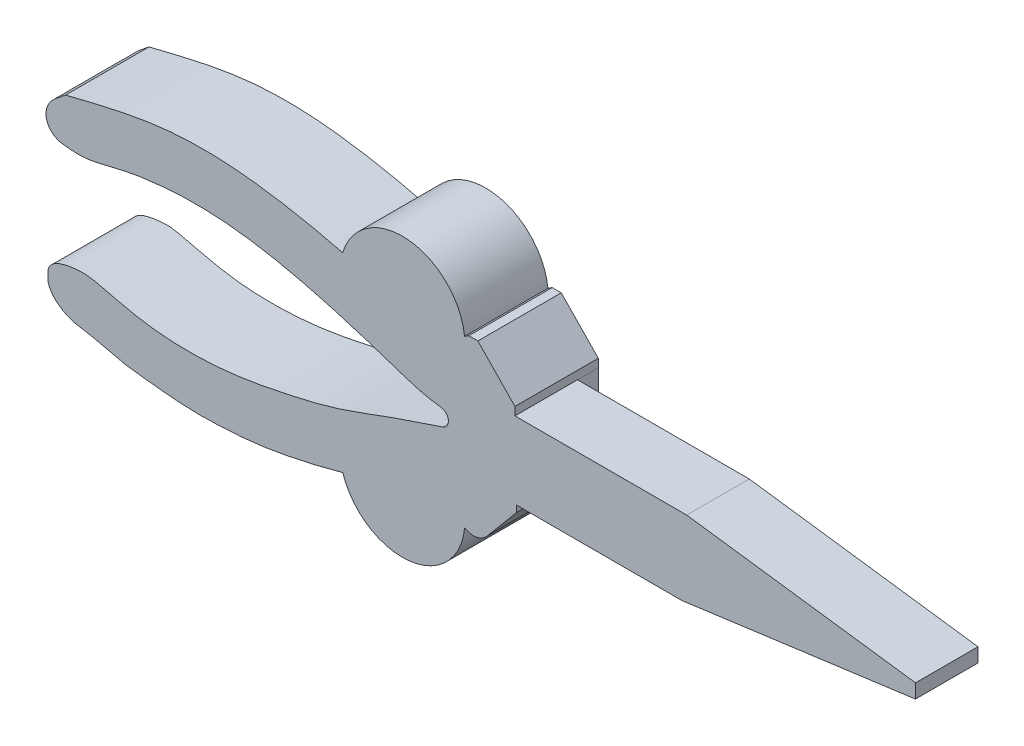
ISO-10303-21;
HEADER;
FILE_DESCRIPTION(('STEP AP214'),'2;1');
FILE_NAME('part.step','',(''),(''),'','','');
FILE_SCHEMA(('AUTOMOTIVE_DESIGN { 1 0 10303 214 1 1 1 1 }'));
ENDSEC;
DATA;
#1=APPLICATION_CONTEXT('core data for automotive mechanical design processes');
#2=APPLICATION_PROTOCOL_DEFINITION('international standard','automotive_design',2000,#1);
#3=PRODUCT_CONTEXT('',#1,'mechanical');
#4=PRODUCT('Part','Part','',(#3));
#5=PRODUCT_RELATED_PRODUCT_CATEGORY('part','',(#4));
#6=PRODUCT_DEFINITION_FORMATION('','',#4);
#7=PRODUCT_DEFINITION_CONTEXT('part definition',#1,'design');
#8=PRODUCT_DEFINITION('design','',#6,#7);
#9=PRODUCT_DEFINITION_SHAPE('','',#8);
#10=(LENGTH_UNIT() NAMED_UNIT(*) SI_UNIT(.MILLI.,.METRE.));
#11=(NAMED_UNIT(*) PLANE_ANGLE_UNIT() SI_UNIT($,.RADIAN.));
#12=(NAMED_UNIT(*) SI_UNIT($,.STERADIAN.) SOLID_ANGLE_UNIT());
#13=UNCERTAINTY_MEASURE_WITH_UNIT(LENGTH_MEASURE(1.E-05),#10,'distance_accuracy_value','');
#14=(GEOMETRIC_REPRESENTATION_CONTEXT(3) GLOBAL_UNCERTAINTY_ASSIGNED_CONTEXT((#13)) GLOBAL_UNIT_ASSIGNED_CONTEXT((#10,
#11,#12)) REPRESENTATION_CONTEXT('',''));
#15=CARTESIAN_POINT('',(0.,0.,0.));
#16=DIRECTION('',(0.,0.,1.));
#17=DIRECTION('',(1.,0.,0.));
#18=AXIS2_PLACEMENT_3D('',#15,#16,#17);
#19=CARTESIAN_POINT('',(105.081366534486,58.1918320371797,-10.));
#20=CARTESIAN_POINT('',(103.260874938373,56.8446480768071,-10.));
#21=CARTESIAN_POINT('',(99.7630534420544,55.8899426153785,-10.));
#22=CARTESIAN_POINT('',(94.8424366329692,55.0678319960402,-10.));
#23=CARTESIAN_POINT('',(89.8832028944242,55.4874259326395,-10.));
#24=CARTESIAN_POINT('',(79.5646371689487,59.2817210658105,-10.));
#25=CARTESIAN_POINT('',(65.4663296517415,62.7295422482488,-10.));
#26=CARTESIAN_POINT('',(47.9189657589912,65.2720516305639,-10.));
#27=CARTESIAN_POINT('',(29.35656931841,65.1365679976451,-10.));
#28=CARTESIAN_POINT('',(16.1917057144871,61.7598729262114,-10.));
#29=CARTESIAN_POINT('',(8.34899105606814,59.8295133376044,-10.));
#30=B_SPLINE_CURVE_WITH_KNOTS('',3,(#19,#20,#21,#22,#23,#24,#25,#26,#27,#28,#29),.UNSPECIFIED.,
.F.,.F.,(4,1,1,1,1,1,1,1,4),(0.,0.0678823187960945,0.108026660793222,0.151230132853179,
0.216928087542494,0.440346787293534,0.590776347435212,0.754259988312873,1.),.UNSPECIFIED.);
#31=DIRECTION('',(0.,0.,1.));
#32=VECTOR('',#31,1.);
#33=SURFACE_OF_LINEAR_EXTRUSION('',#30,#32);
#34=DIRECTION('',(0.,0.,1.));
#35=VECTOR('',#34,1.);
#36=CARTESIAN_POINT('',(104.060237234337,57.5314803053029,-10.));
#37=LINE('',#36,#35);
#38=CARTESIAN_POINT('',(104.060237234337,57.5314803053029,10.));
#39=VERTEX_POINT('',#38);
#40=CARTESIAN_POINT('',(104.060237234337,57.5314803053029,-10.));
#41=VERTEX_POINT('',#40);
#42=EDGE_CURVE('E173',#39,#41,#37,.F.);
#43=ORIENTED_EDGE('',*,*,#42,.F.);
#44=CARTESIAN_POINT('',(105.081366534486,58.1918320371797,10.));
#45=CARTESIAN_POINT('',(103.260874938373,56.8446480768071,10.));
#46=CARTESIAN_POINT('',(99.7630534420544,55.8899426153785,10.));
#47=CARTESIAN_POINT('',(94.8424366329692,55.0678319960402,10.));
#48=CARTESIAN_POINT('',(89.8832028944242,55.4874259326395,10.));
#49=CARTESIAN_POINT('',(79.5646371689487,59.2817210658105,10.));
#50=CARTESIAN_POINT('',(65.4663296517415,62.7295422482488,10.));
#51=CARTESIAN_POINT('',(47.9189657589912,65.2720516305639,10.));
#52=CARTESIAN_POINT('',(29.35656931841,65.1365679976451,10.));
#53=CARTESIAN_POINT('',(16.1917057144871,61.7598729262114,10.));
#54=CARTESIAN_POINT('',(8.34899105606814,59.8295133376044,10.));
#55=B_SPLINE_CURVE_WITH_KNOTS('',3,(#44,#45,#46,#47,#48,#49,#50,#51,#52,#53,#54),.UNSPECIFIED.,
.F.,.F.,(4,1,1,1,1,1,1,1,4),(0.,0.0678823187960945,0.108026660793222,0.151230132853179,
0.216928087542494,0.440346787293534,0.590776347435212,0.754259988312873,1.),.UNSPECIFIED.);
#56=CARTESIAN_POINT('',(105.081366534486,58.1918320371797,10.));
#57=VERTEX_POINT('',#56);
#58=EDGE_CURVE('E184',#57,#39,#55,.T.);
#59=ORIENTED_EDGE('',*,*,#58,.F.);
#60=DIRECTION('',(0.,0.,1.));
#61=VECTOR('',#60,1.);
#62=CARTESIAN_POINT('',(105.081366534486,58.1918320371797,-10.));
#63=LINE('',#62,#61);
#64=CARTESIAN_POINT('',(105.081366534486,58.1918320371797,-10.));
#65=VERTEX_POINT('',#64);
#66=EDGE_CURVE('E50',#65,#57,#63,.T.);
#67=ORIENTED_EDGE('',*,*,#66,.F.);
#68=EDGE_CURVE('E186',#65,#41,#30,.T.);
#69=ORIENTED_EDGE('',*,*,#68,.T.);
#70=EDGE_LOOP('',(#43,#59,#67,#69));
#71=FACE_BOUND('',#70,.T.);
#72=ADVANCED_FACE('F39',(#71),#33,.T.);
#73=CARTESIAN_POINT('',(98.7745133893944,36.0895743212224,-10.));
#74=CARTESIAN_POINT('',(98.3839605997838,35.9673496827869,-10.));
#75=CARTESIAN_POINT('',(96.5133406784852,35.3540405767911,-10.));
#76=CARTESIAN_POINT('',(92.6416444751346,33.9074025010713,-10.));
#77=CARTESIAN_POINT('',(87.4091637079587,32.3077912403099,-10.));
#78=CARTESIAN_POINT('',(79.9685283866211,29.4827278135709,-10.));
#79=CARTESIAN_POINT('',(72.1462388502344,26.6746762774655,-10.));
#80=CARTESIAN_POINT('',(62.4721778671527,24.431454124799,-10.));
#81=CARTESIAN_POINT('',(54.7601704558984,22.8159102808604,-10.));
#82=CARTESIAN_POINT('',(46.4592535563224,21.6212708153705,-10.));
#83=CARTESIAN_POINT('',(39.4599670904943,21.2142235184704,-10.));
#84=CARTESIAN_POINT('',(31.7889633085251,21.4305123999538,-10.));
#85=CARTESIAN_POINT('',(24.1312572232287,22.420382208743,-10.));
#86=CARTESIAN_POINT('',(17.9210336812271,24.1754798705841,-10.));
#87=CARTESIAN_POINT('',(13.4821227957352,25.0431723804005,-10.));
#88=CARTESIAN_POINT('',(10.7651070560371,24.938584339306,-10.));
#89=CARTESIAN_POINT('',(7.99114721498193,24.5227222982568,-10.));
#90=CARTESIAN_POINT('',(5.43195618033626,23.541150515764,-10.));
#91=CARTESIAN_POINT('',(4.1970172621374,22.0662590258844,-10.));
#92=CARTESIAN_POINT('',(4.04876908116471,20.4162709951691,-10.));
#93=CARTESIAN_POINT('',(4.02591520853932,18.5754693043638,-10.));
#94=CARTESIAN_POINT('',(5.41501822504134,16.3722608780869,-10.));
#95=CARTESIAN_POINT('',(7.67800527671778,14.5779138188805,-10.));
#96=CARTESIAN_POINT('',(10.3556830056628,13.5055331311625,-10.));
#97=CARTESIAN_POINT('',(13.0980103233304,13.2003230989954,-10.));
#98=CARTESIAN_POINT('',(15.6983016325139,12.6091593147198,-10.));
#99=CARTESIAN_POINT('',(18.7067694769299,11.9610882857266,-10.));
#100=CARTESIAN_POINT('',(22.0713588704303,11.0165469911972,-10.));
#101=CARTESIAN_POINT('',(26.4605830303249,10.5242011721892,-10.));
#102=CARTESIAN_POINT('',(32.2577083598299,9.88042322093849,-10.));
#103=CARTESIAN_POINT('',(38.8989642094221,9.33061911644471,-10.));
#104=CARTESIAN_POINT('',(45.7877296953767,9.5787969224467,-10.));
#105=CARTESIAN_POINT('',(53.3321304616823,10.0307293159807,-10.));
#106=CARTESIAN_POINT('',(63.1437710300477,11.6557363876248,-10.));
#107=CARTESIAN_POINT('',(75.0379929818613,14.4975635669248,-10.));
#108=CARTESIAN_POINT('',(84.9895786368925,17.8133751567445,-10.));
#109=CARTESIAN_POINT('',(91.9187128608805,20.1058837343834,-10.));
#110=CARTESIAN_POINT('',(96.2191427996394,20.1981215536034,-10.));
#111=CARTESIAN_POINT('',(99.7783118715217,19.571207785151,-10.));
#112=CARTESIAN_POINT('',(102.753971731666,18.484286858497,-10.));
#113=CARTESIAN_POINT('',(104.697927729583,17.3717739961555,-10.));
#114=CARTESIAN_POINT('',(107.152854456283,17.0083571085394,-10.));
#115=CARTESIAN_POINT('',(108.676971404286,17.8989454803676,-10.));
#116=CARTESIAN_POINT('',(109.427452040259,18.7086105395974,-10.));
#117=B_SPLINE_CURVE_WITH_KNOTS('',3,(#73,#74,#75,#76,#77,#78,#79,#80,#81,#82,#83,#84,#85,#86,
#87,#88,#89,#90,#91,#92,#93,#94,#95,#96,#97,#98,#99,#100,#101,#102,#103,#104,#105,#106,#107,
#108,#109,#110,#111,#112,#113,#114,#115,#116),.UNSPECIFIED.,.F.,.F.,(4,1,1,1,1,1,1,1,1,1,1,1,1,
1,1,1,1,1,1,1,1,1,1,1,1,1,1,1,1,1,1,1,1,1,1,1,1,1,1,1,1,4),(0.0666927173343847,
0.0721112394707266,0.0927519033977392,0.121627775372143,0.144672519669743,0.198434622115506,
0.231751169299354,0.27642440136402,0.303019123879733,0.343035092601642,0.369314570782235,
0.404855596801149,0.445144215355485,0.455026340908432,0.464647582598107,0.481051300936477,
0.492169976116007,0.50047082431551,0.504660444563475,0.513931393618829,0.524327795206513,
0.537758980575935,0.551907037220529,0.561905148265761,0.574300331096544,0.587283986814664,
0.602777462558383,0.62060115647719,0.645778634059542,0.680302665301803,0.708898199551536,
0.737215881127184,0.780596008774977,0.840739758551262,0.89926068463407,0.920214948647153,
0.936982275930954,0.955760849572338,0.967889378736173,0.978912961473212,0.985237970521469,1.),.UNSPECIFIED.);
#118=DIRECTION('',(0.,0.,1.));
#119=VECTOR('',#118,1.);
#120=SURFACE_OF_LINEAR_EXTRUSION('',#117,#119);
#121=DIRECTION('',(0.,0.,1.));
#122=VECTOR('',#121,1.);
#123=CARTESIAN_POINT('',(74.8485206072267,14.6458521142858,-10.));
#124=LINE('',#123,#122);
#125=CARTESIAN_POINT('',(74.8485206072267,14.6458521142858,10.));
#126=VERTEX_POINT('',#125);
#127=CARTESIAN_POINT('',(74.8485206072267,14.6458521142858,-10.));
#128=VERTEX_POINT('',#127);
#129=EDGE_CURVE('E428',#126,#128,#124,.F.);
#130=ORIENTED_EDGE('',*,*,#129,.F.);
#131=CARTESIAN_POINT('',(98.7745133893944,36.0895743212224,10.));
#132=CARTESIAN_POINT('',(98.3839605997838,35.9673496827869,10.));
#133=CARTESIAN_POINT('',(96.5133406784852,35.3540405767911,10.));
#134=CARTESIAN_POINT('',(92.6416444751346,33.9074025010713,10.));
#135=CARTESIAN_POINT('',(87.4091637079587,32.3077912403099,10.));
#136=CARTESIAN_POINT('',(79.9685283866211,29.4827278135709,10.));
#137=CARTESIAN_POINT('',(72.1462388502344,26.6746762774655,10.));
#138=CARTESIAN_POINT('',(62.4721778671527,24.431454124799,10.));
#139=CARTESIAN_POINT('',(54.7601704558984,22.8159102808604,10.));
#140=CARTESIAN_POINT('',(46.4592535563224,21.6212708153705,10.));
#141=CARTESIAN_POINT('',(39.4599670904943,21.2142235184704,10.));
#142=CARTESIAN_POINT('',(31.7889633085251,21.4305123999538,10.));
#143=CARTESIAN_POINT('',(24.1312572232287,22.420382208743,10.));
#144=CARTESIAN_POINT('',(17.9210336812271,24.1754798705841,10.));
#145=CARTESIAN_POINT('',(13.4821227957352,25.0431723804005,10.));
#146=CARTESIAN_POINT('',(10.7651070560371,24.938584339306,10.));
#147=CARTESIAN_POINT('',(7.99114721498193,24.5227222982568,10.));
#148=CARTESIAN_POINT('',(5.43195618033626,23.541150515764,10.));
#149=CARTESIAN_POINT('',(4.1970172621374,22.0662590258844,10.));
#150=CARTESIAN_POINT('',(4.04876908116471,20.4162709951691,10.));
#151=CARTESIAN_POINT('',(4.02591520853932,18.5754693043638,10.));
#152=CARTESIAN_POINT('',(5.41501822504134,16.3722608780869,10.));
#153=CARTESIAN_POINT('',(7.67800527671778,14.5779138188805,10.));
#154=CARTESIAN_POINT('',(10.3556830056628,13.5055331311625,10.));
#155=CARTESIAN_POINT('',(13.0980103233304,13.2003230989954,10.));
#156=CARTESIAN_POINT('',(15.6983016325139,12.6091593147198,10.));
#157=CARTESIAN_POINT('',(18.7067694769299,11.9610882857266,10.));
#158=CARTESIAN_POINT('',(22.0713588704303,11.0165469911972,10.));
#159=CARTESIAN_POINT('',(26.4605830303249,10.5242011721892,10.));
#160=CARTESIAN_POINT('',(32.2577083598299,9.88042322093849,10.));
#161=CARTESIAN_POINT('',(38.8989642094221,9.33061911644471,10.));
#162=CARTESIAN_POINT('',(45.7877296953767,9.5787969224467,10.));
#163=CARTESIAN_POINT('',(53.3321304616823,10.0307293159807,10.));
#164=CARTESIAN_POINT('',(63.1437710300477,11.6557363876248,10.));
#165=CARTESIAN_POINT('',(75.0379929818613,14.4975635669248,10.));
#166=CARTESIAN_POINT('',(84.9895786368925,17.8133751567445,10.));
#167=CARTESIAN_POINT('',(91.9187128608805,20.1058837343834,10.));
#168=CARTESIAN_POINT('',(96.2191427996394,20.1981215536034,10.));
#169=CARTESIAN_POINT('',(99.7783118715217,19.571207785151,10.));
#170=CARTESIAN_POINT('',(102.753971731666,18.484286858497,10.));
#171=CARTESIAN_POINT('',(104.697927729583,17.3717739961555,10.));
#172=CARTESIAN_POINT('',(107.152854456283,17.0083571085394,10.));
#173=CARTESIAN_POINT('',(108.676971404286,17.8989454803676,10.));
#174=CARTESIAN_POINT('',(109.427452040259,18.7086105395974,10.));
#175=B_SPLINE_CURVE_WITH_KNOTS('',3,(#131,#132,#133,#134,#135,#136,#137,#138,#139,#140,#141,
#142,#143,#144,#145,#146,#147,#148,#149,#150,#151,#152,#153,#154,#155,#156,#157,#158,#159,#160,
#161,#162,#163,#164,#165,#166,#167,#168,#169,#170,#171,#172,#173,#174),.UNSPECIFIED.,.F.,.F.,(4,
1,1,1,1,1,1,1,1,1,1,1,1,1,1,1,1,1,1,1,1,1,1,1,1,1,1,1,1,1,1,1,1,1,1,1,1,1,1,1,1,4),
(0.0666927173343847,0.0721112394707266,0.0927519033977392,0.121627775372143,0.144672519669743,
0.198434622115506,0.231751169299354,0.27642440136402,0.303019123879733,0.343035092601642,
0.369314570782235,0.404855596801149,0.445144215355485,0.455026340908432,0.464647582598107,
0.481051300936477,0.492169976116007,0.50047082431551,0.504660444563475,0.513931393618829,
0.524327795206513,0.537758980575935,0.551907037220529,0.561905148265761,0.574300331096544,
0.587283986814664,0.602777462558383,0.62060115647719,0.645778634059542,0.680302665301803,
0.708898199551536,0.737215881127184,0.780596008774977,0.840739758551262,0.89926068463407,
0.920214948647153,0.936982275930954,0.955760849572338,0.967889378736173,0.978912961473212,
0.985237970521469,1.),.UNSPECIFIED.);
#176=CARTESIAN_POINT('',(98.7745133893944,36.0895743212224,10.));
#177=VERTEX_POINT('',#176);
#178=EDGE_CURVE('E356',#177,#126,#175,.T.);
#179=ORIENTED_EDGE('',*,*,#178,.F.);
#180=DIRECTION('',(0.,0.,1.));
#181=VECTOR('',#180,1.);
#182=CARTESIAN_POINT('',(98.7745133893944,36.0895743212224,-10.));
#183=LINE('',#182,#181);
#184=CARTESIAN_POINT('',(98.7745133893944,36.0895743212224,-10.));
#185=VERTEX_POINT('',#184);
#186=EDGE_CURVE('E328',#185,#177,#183,.T.);
#187=ORIENTED_EDGE('',*,*,#186,.F.);
#188=EDGE_CURVE('E220',#185,#128,#117,.T.);
#189=ORIENTED_EDGE('',*,*,#188,.T.);
#190=EDGE_LOOP('',(#130,#179,#187,#189));
#191=FACE_BOUND('',#190,.T.);
#192=ADVANCED_FACE('F239',(#191),#120,.T.);
#193=CARTESIAN_POINT('',(8.34899105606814,59.8295133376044,-10.));
#194=CARTESIAN_POINT('',(6.85934389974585,58.6039412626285,-10.));
#195=CARTESIAN_POINT('',(3.85265791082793,56.7685163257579,-10.));
#196=CARTESIAN_POINT('',(3.34661723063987,51.9093904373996,-10.));
#197=CARTESIAN_POINT('',(5.8504818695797,49.4848987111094,-10.));
#198=CARTESIAN_POINT('',(8.57244861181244,49.1853232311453,-10.));
#199=CARTESIAN_POINT('',(11.0923421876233,48.960172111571,-10.));
#200=CARTESIAN_POINT('',(14.0880801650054,49.1263938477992,-10.));
#201=CARTESIAN_POINT('',(17.6126879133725,49.9518945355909,-10.));
#202=CARTESIAN_POINT('',(21.2387045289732,50.847664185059,-10.));
#203=CARTESIAN_POINT('',(25.4336635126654,51.7441347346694,-10.));
#204=CARTESIAN_POINT('',(29.379020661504,52.2019927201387,-10.));
#205=CARTESIAN_POINT('',(33.8097883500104,52.687522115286,-10.));
#206=CARTESIAN_POINT('',(38.6106806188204,52.8490917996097,-10.));
#207=CARTESIAN_POINT('',(44.7916603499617,52.7436727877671,-10.));
#208=CARTESIAN_POINT('',(51.8408097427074,52.0485053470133,-10.));
#209=CARTESIAN_POINT('',(61.3012925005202,50.4045073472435,-10.));
#210=CARTESIAN_POINT('',(71.0747777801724,47.9375851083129,-10.));
#211=CARTESIAN_POINT('',(80.3158124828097,45.1229603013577,-10.));
#212=CARTESIAN_POINT('',(87.639086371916,42.7228085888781,-10.));
#213=CARTESIAN_POINT('',(93.330038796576,40.7355705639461,-10.));
#214=CARTESIAN_POINT('',(97.1358552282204,40.148171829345,-10.));
#215=CARTESIAN_POINT('',(98.4315220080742,39.9820490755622,-10.));
#216=B_SPLINE_CURVE_WITH_KNOTS('',3,(#193,#194,#195,#196,#197,#198,#199,#200,#201,#202,#203,
#204,#205,#206,#207,#208,#209,#210,#211,#212,#213,#214,#215),.UNSPECIFIED.,.F.,.F.,(4,1,1,1,1,1,
1,1,1,1,1,1,1,1,1,1,1,1,1,1,4),(0.,0.0494547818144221,0.0771613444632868,0.107433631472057,
0.122865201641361,0.143705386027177,0.169550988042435,0.19589094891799,0.232278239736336,
0.261148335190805,0.300925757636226,0.329534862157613,0.370371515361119,0.418537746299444,
0.480962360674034,0.543734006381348,0.653720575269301,0.727747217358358,0.780389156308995,
0.842788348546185,0.874758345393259),.UNSPECIFIED.);
#217=DIRECTION('',(0.,0.,1.));
#218=VECTOR('',#217,1.);
#219=SURFACE_OF_LINEAR_EXTRUSION('',#216,#218);
#220=DIRECTION('',(0.,0.,1.));
#221=VECTOR('',#220,1.);
#222=CARTESIAN_POINT('',(98.4315220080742,39.9820490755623,-10.));
#223=LINE('',#222,#221);
#224=CARTESIAN_POINT('',(98.4315220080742,39.9820490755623,-10.));
#225=VERTEX_POINT('',#224);
#226=CARTESIAN_POINT('',(98.4315220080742,39.9820490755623,10.));
#227=VERTEX_POINT('',#226);
#228=EDGE_CURVE('E44',#225,#227,#223,.T.);
#229=ORIENTED_EDGE('',*,*,#228,.T.);
#230=CARTESIAN_POINT('',(8.34899105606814,59.8295133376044,10.));
#231=CARTESIAN_POINT('',(6.85934389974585,58.6039412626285,10.));
#232=CARTESIAN_POINT('',(3.85265791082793,56.7685163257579,10.));
#233=CARTESIAN_POINT('',(3.34661723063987,51.9093904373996,10.));
#234=CARTESIAN_POINT('',(5.8504818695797,49.4848987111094,10.));
#235=CARTESIAN_POINT('',(8.57244861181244,49.1853232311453,10.));
#236=CARTESIAN_POINT('',(11.0923421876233,48.960172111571,10.));
#237=CARTESIAN_POINT('',(14.0880801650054,49.1263938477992,10.));
#238=CARTESIAN_POINT('',(17.6126879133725,49.9518945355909,10.));
#239=CARTESIAN_POINT('',(21.2387045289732,50.847664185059,10.));
#240=CARTESIAN_POINT('',(25.4336635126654,51.7441347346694,10.));
#241=CARTESIAN_POINT('',(29.379020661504,52.2019927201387,10.));
#242=CARTESIAN_POINT('',(33.8097883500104,52.687522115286,10.));
#243=CARTESIAN_POINT('',(38.6106806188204,52.8490917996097,10.));
#244=CARTESIAN_POINT('',(44.7916603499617,52.7436727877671,10.));
#245=CARTESIAN_POINT('',(51.8408097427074,52.0485053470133,10.));
#246=CARTESIAN_POINT('',(61.3012925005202,50.4045073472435,10.));
#247=CARTESIAN_POINT('',(71.0747777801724,47.9375851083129,10.));
#248=CARTESIAN_POINT('',(80.3158124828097,45.1229603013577,10.));
#249=CARTESIAN_POINT('',(87.639086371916,42.7228085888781,10.));
#250=CARTESIAN_POINT('',(93.330038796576,40.7355705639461,10.));
#251=CARTESIAN_POINT('',(97.1358552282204,40.148171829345,10.));
#252=CARTESIAN_POINT('',(98.4315220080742,39.9820490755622,10.));
#253=B_SPLINE_CURVE_WITH_KNOTS('',3,(#230,#231,#232,#233,#234,#235,#236,#237,#238,#239,#240,
#241,#242,#243,#244,#245,#246,#247,#248,#249,#250,#251,#252),.UNSPECIFIED.,.F.,.F.,(4,1,1,1,1,1,
1,1,1,1,1,1,1,1,1,1,1,1,1,1,4),(0.,0.0494547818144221,0.0771613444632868,0.107433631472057,
0.122865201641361,0.143705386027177,0.169550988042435,0.19589094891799,0.232278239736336,
0.261148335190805,0.300925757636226,0.329534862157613,0.370371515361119,0.418537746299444,
0.480962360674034,0.543734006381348,0.653720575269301,0.727747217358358,0.780389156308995,
0.842788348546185,0.874758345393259),.UNSPECIFIED.);
#254=CARTESIAN_POINT('',(8.34899105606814,59.8295133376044,10.));
#255=VERTEX_POINT('',#254);
#256=EDGE_CURVE('E335',#255,#227,#253,.T.);
#257=ORIENTED_EDGE('',*,*,#256,.F.);
#258=DIRECTION('',(0.,0.,1.));
#259=VECTOR('',#258,1.);
#260=CARTESIAN_POINT('',(8.34899105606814,59.8295133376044,-10.));
#261=LINE('',#260,#259);
#262=CARTESIAN_POINT('',(8.34899105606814,59.8295133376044,-10.));
#263=VERTEX_POINT('',#262);
#264=EDGE_CURVE('E11',#263,#255,#261,.T.);
#265=ORIENTED_EDGE('',*,*,#264,.F.);
#266=EDGE_CURVE('E195',#263,#225,#216,.T.);
#267=ORIENTED_EDGE('',*,*,#266,.T.);
#268=EDGE_LOOP('',(#229,#257,#265,#267));
#269=FACE_BOUND('',#268,.T.);
#270=ADVANCED_FACE('F41',(#269),#219,.T.);
#271=DIRECTION('',(0.,0.,1.));
#272=VECTOR('',#271,1.);
#273=CARTESIAN_POINT('',(74.8002041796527,60.2991630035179,-10.));
#274=LINE('',#273,#272);
#275=CARTESIAN_POINT('',(74.8002041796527,60.2991630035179,-10.));
#276=VERTEX_POINT('',#275);
#277=CARTESIAN_POINT('',(74.8002041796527,60.2991630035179,10.));
#278=VERTEX_POINT('',#277);
#279=EDGE_CURVE('E176',#276,#278,#274,.T.);
#280=ORIENTED_EDGE('',*,*,#279,.F.);
#281=EDGE_CURVE('E272',#276,#263,#30,.T.);
#282=ORIENTED_EDGE('',*,*,#281,.T.);
#283=ORIENTED_EDGE('',*,*,#264,.T.);
#284=EDGE_CURVE('E196',#278,#255,#55,.T.);
#285=ORIENTED_EDGE('',*,*,#284,.F.);
#286=EDGE_LOOP('',(#280,#282,#283,#285));
#287=FACE_BOUND('',#286,.T.);
#288=ADVANCED_FACE('F253',(#287),#33,.T.);
#289=CARTESIAN_POINT('',(105.081366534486,58.1918320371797,-10.));
#290=DIRECTION('',(0.,1.,0.));
#291=DIRECTION('',(0.,0.,1.));
#292=AXIS2_PLACEMENT_3D('',#289,#290,#291);
#293=PLANE('',#292);
#294=ORIENTED_EDGE('',*,*,#66,.T.);
#295=DIRECTION('',(-1.,0.,0.));
#296=VECTOR('',#295,1.);
#297=CARTESIAN_POINT('',(105.081366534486,58.1918320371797,10.));
#298=LINE('',#297,#296);
#299=CARTESIAN_POINT('',(107.251737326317,58.1918320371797,10.));
#300=VERTEX_POINT('',#299);
#301=EDGE_CURVE('E193',#300,#57,#298,.T.);
#302=ORIENTED_EDGE('',*,*,#301,.F.);
#303=DIRECTION('',(0.,0.,1.));
#304=VECTOR('',#303,1.);
#305=CARTESIAN_POINT('',(107.251737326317,58.1918320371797,-10.));
#306=LINE('',#305,#304);
#307=CARTESIAN_POINT('',(107.251737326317,58.1918320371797,-10.));
#308=VERTEX_POINT('',#307);
#309=EDGE_CURVE('E295',#308,#300,#306,.T.);
#310=ORIENTED_EDGE('',*,*,#309,.F.);
#311=DIRECTION('',(-1.,0.,0.));
#312=VECTOR('',#311,1.);
#313=CARTESIAN_POINT('',(105.081366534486,58.1918320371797,-10.));
#314=LINE('',#313,#312);
#315=EDGE_CURVE('E279',#308,#65,#314,.T.);
#316=ORIENTED_EDGE('',*,*,#315,.T.);
#317=EDGE_LOOP('',(#294,#302,#310,#316));
#318=FACE_BOUND('',#317,.T.);
#319=ADVANCED_FACE('F262',(#318),#293,.T.);
#320=CARTESIAN_POINT('',(107.251737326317,58.1918320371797,-10.));
#321=DIRECTION('',(0.717346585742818,0.696716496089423,0.));
#322=DIRECTION('',(-0.696716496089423,0.717346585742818,0.));
#323=AXIS2_PLACEMENT_3D('',#320,#321,#322);
#324=PLANE('',#323);
#325=ORIENTED_EDGE('',*,*,#309,.T.);
#326=DIRECTION('',(-0.696716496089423,0.717346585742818,0.));
#327=VECTOR('',#326,1.);
#328=CARTESIAN_POINT('',(107.251737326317,58.1918320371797,10.));
#329=LINE('',#328,#327);
#330=CARTESIAN_POINT('',(116.146968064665,49.0332095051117,10.));
#331=VERTEX_POINT('',#330);
#332=EDGE_CURVE('E395',#331,#300,#329,.T.);
#333=ORIENTED_EDGE('',*,*,#332,.F.);
#334=DIRECTION('',(0.,0.,1.));
#335=VECTOR('',#334,1.);
#336=CARTESIAN_POINT('',(116.146968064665,49.0332095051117,-10.));
#337=LINE('',#336,#335);
#338=CARTESIAN_POINT('',(116.146968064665,49.0332095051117,-10.));
#339=VERTEX_POINT('',#338);
#340=EDGE_CURVE('E298',#339,#331,#337,.T.);
#341=ORIENTED_EDGE('',*,*,#340,.F.);
#342=DIRECTION('',(-0.696716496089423,0.717346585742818,0.));
#343=VECTOR('',#342,1.);
#344=CARTESIAN_POINT('',(107.251737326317,58.1918320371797,-10.));
#345=LINE('',#344,#343);
#346=EDGE_CURVE('E283',#339,#308,#345,.T.);
#347=ORIENTED_EDGE('',*,*,#346,.T.);
#348=EDGE_LOOP('',(#325,#333,#341,#347));
#349=FACE_BOUND('',#348,.T.);
#350=ADVANCED_FACE('F267',(#349),#324,.T.);
#351=CARTESIAN_POINT('',(116.146968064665,49.0332095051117,-10.));
#352=DIRECTION('',(1.,0.,0.));
#353=DIRECTION('',(0.,0.,-1.));
#354=AXIS2_PLACEMENT_3D('',#351,#352,#353);
#355=PLANE('',#354);
#356=ORIENTED_EDGE('',*,*,#340,.T.);
#357=DIRECTION('',(0.,1.,0.));
#358=VECTOR('',#357,1.);
#359=CARTESIAN_POINT('',(116.146968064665,49.0332095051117,10.));
#360=LINE('',#359,#358);
#361=CARTESIAN_POINT('',(116.146968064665,47.0677788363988,10.));
#362=VERTEX_POINT('',#361);
#363=EDGE_CURVE('E392',#362,#331,#360,.T.);
#364=ORIENTED_EDGE('',*,*,#363,.F.);
#365=DIRECTION('',(0.,0.,1.));
#366=VECTOR('',#365,1.);
#367=CARTESIAN_POINT('',(116.146968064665,47.0677788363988,-10.));
#368=LINE('',#367,#366);
#369=CARTESIAN_POINT('',(116.146968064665,47.0677788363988,-5.));
#370=VERTEX_POINT('',#369);
#371=EDGE_CURVE('E304',#370,#362,#368,.T.);
#372=ORIENTED_EDGE('',*,*,#371,.F.);
#373=CARTESIAN_POINT('',(116.146968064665,47.0677788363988,-10.));
#374=VERTEX_POINT('',#373);
#375=EDGE_CURVE('E301',#374,#370,#368,.T.);
#376=ORIENTED_EDGE('',*,*,#375,.F.);
#377=DIRECTION('',(0.,1.,0.));
#378=VECTOR('',#377,1.);
#379=CARTESIAN_POINT('',(116.146968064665,49.0332095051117,-10.));
#380=LINE('',#379,#378);
#381=EDGE_CURVE('E407',#374,#339,#380,.T.);
#382=ORIENTED_EDGE('',*,*,#381,.T.);
#383=EDGE_LOOP('',(#356,#364,#372,#376,#382));
#384=FACE_BOUND('',#383,.T.);
#385=ADVANCED_FACE('F582',(#384),#355,.T.);
#386=CARTESIAN_POINT('',(116.146968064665,47.0677788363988,-10.));
#387=DIRECTION('',(0.,1.,0.));
#388=DIRECTION('',(0.,0.,1.));
#389=AXIS2_PLACEMENT_3D('',#386,#387,#388);
#390=PLANE('',#389);
#391=DIRECTION('',(1.,0.,0.));
#392=VECTOR('',#391,1.);
#393=CARTESIAN_POINT('',(157.355628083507,47.0677788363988,-5.));
#394=LINE('',#393,#392);
#395=CARTESIAN_POINT('',(157.355628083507,47.0677788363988,-5.));
#396=VERTEX_POINT('',#395);
#397=EDGE_CURVE('E432',#370,#396,#394,.T.);
#398=ORIENTED_EDGE('',*,*,#397,.F.);
#399=ORIENTED_EDGE('',*,*,#371,.T.);
#400=DIRECTION('',(-1.,0.,0.));
#401=VECTOR('',#400,1.);
#402=CARTESIAN_POINT('',(116.146968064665,47.0677788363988,10.));
#403=LINE('',#402,#401);
#404=CARTESIAN_POINT('',(157.355628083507,47.0677788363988,10.));
#405=VERTEX_POINT('',#404);
#406=EDGE_CURVE('E388',#405,#362,#403,.T.);
#407=ORIENTED_EDGE('',*,*,#406,.F.);
#408=DIRECTION('',(0.,0.,1.));
#409=VECTOR('',#408,1.);
#410=CARTESIAN_POINT('',(157.355628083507,47.0677788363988,-10.));
#411=LINE('',#410,#409);
#412=EDGE_CURVE('E305',#396,#405,#411,.T.);
#413=ORIENTED_EDGE('',*,*,#412,.F.);
#414=EDGE_LOOP('',(#398,#399,#407,#413));
#415=FACE_BOUND('',#414,.T.);
#416=ADVANCED_FACE('F478',(#415),#390,.T.);
#417=CARTESIAN_POINT('',(157.355628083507,47.0677788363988,-10.));
#418=DIRECTION('',(0.133944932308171,0.990988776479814,0.));
#419=DIRECTION('',(-0.990988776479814,0.133944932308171,0.));
#420=AXIS2_PLACEMENT_3D('',#417,#418,#419);
#421=PLANE('',#420);
#422=DIRECTION('',(0.990988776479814,-0.133944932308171,0.));
#423=VECTOR('',#422,1.);
#424=CARTESIAN_POINT('',(212.232944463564,39.650400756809,-5.));
#425=LINE('',#424,#423);
#426=CARTESIAN_POINT('',(212.232944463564,39.650400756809,-5.));
#427=VERTEX_POINT('',#426);
#428=EDGE_CURVE('E445',#396,#427,#425,.T.);
#429=ORIENTED_EDGE('',*,*,#428,.F.);
#430=ORIENTED_EDGE('',*,*,#412,.T.);
#431=DIRECTION('',(-0.990988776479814,0.133944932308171,0.));
#432=VECTOR('',#431,1.);
#433=CARTESIAN_POINT('',(157.355628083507,47.0677788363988,10.));
#434=LINE('',#433,#432);
#435=CARTESIAN_POINT('',(212.232944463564,39.650400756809,10.));
#436=VERTEX_POINT('',#435);
#437=EDGE_CURVE('E384',#436,#405,#434,.T.);
#438=ORIENTED_EDGE('',*,*,#437,.F.);
#439=DIRECTION('',(0.,0.,1.));
#440=VECTOR('',#439,1.);
#441=CARTESIAN_POINT('',(212.232944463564,39.650400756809,-10.));
#442=LINE('',#441,#440);
#443=EDGE_CURVE('E308',#427,#436,#442,.T.);
#444=ORIENTED_EDGE('',*,*,#443,.F.);
#445=EDGE_LOOP('',(#429,#430,#438,#444));
#446=FACE_BOUND('',#445,.T.);
#447=ADVANCED_FACE('F473',(#446),#421,.T.);
#448=CARTESIAN_POINT('',(212.232944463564,39.650400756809,-10.));
#449=DIRECTION('',(1.,0.,0.));
#450=DIRECTION('',(0.,0.,-1.));
#451=AXIS2_PLACEMENT_3D('',#448,#449,#450);
#452=PLANE('',#451);
#453=DIRECTION('',(0.,-1.,0.));
#454=VECTOR('',#453,1.);
#455=CARTESIAN_POINT('',(212.232944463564,36.274476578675,-5.));
#456=LINE('',#455,#454);
#457=CARTESIAN_POINT('',(212.232944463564,36.274476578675,-5.));
#458=VERTEX_POINT('',#457);
#459=EDGE_CURVE('E448',#427,#458,#456,.T.);
#460=ORIENTED_EDGE('',*,*,#459,.F.);
#461=ORIENTED_EDGE('',*,*,#443,.T.);
#462=DIRECTION('',(0.,1.,0.));
#463=VECTOR('',#462,1.);
#464=CARTESIAN_POINT('',(212.232944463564,39.650400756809,10.));
#465=LINE('',#464,#463);
#466=CARTESIAN_POINT('',(212.232944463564,36.274476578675,10.));
#467=VERTEX_POINT('',#466);
#468=EDGE_CURVE('E380',#467,#436,#465,.T.);
#469=ORIENTED_EDGE('',*,*,#468,.F.);
#470=DIRECTION('',(0.,0.,1.));
#471=VECTOR('',#470,1.);
#472=CARTESIAN_POINT('',(212.232944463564,36.274476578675,-10.));
#473=LINE('',#472,#471);
#474=EDGE_CURVE('E311',#458,#467,#473,.T.);
#475=ORIENTED_EDGE('',*,*,#474,.F.);
#476=EDGE_LOOP('',(#460,#461,#469,#475));
#477=FACE_BOUND('',#476,.T.);
#478=ADVANCED_FACE('F469',(#477),#452,.T.);
#479=CARTESIAN_POINT('',(212.232944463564,36.274476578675,-10.));
#480=DIRECTION('',(0.133419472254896,-0.991059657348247,0.));
#481=DIRECTION('',(0.991059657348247,0.133419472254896,0.));
#482=AXIS2_PLACEMENT_3D('',#479,#480,#481);
#483=PLANE('',#482);
#484=DIRECTION('',(-0.991059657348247,-0.133419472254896,0.));
#485=VECTOR('',#484,1.);
#486=CARTESIAN_POINT('',(156.209057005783,28.7323700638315,-5.));
#487=LINE('',#486,#485);
#488=CARTESIAN_POINT('',(156.209057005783,28.7323700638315,-5.));
#489=VERTEX_POINT('',#488);
#490=EDGE_CURVE('E346',#458,#489,#487,.T.);
#491=ORIENTED_EDGE('',*,*,#490,.F.);
#492=ORIENTED_EDGE('',*,*,#474,.T.);
#493=DIRECTION('',(0.991059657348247,0.133419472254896,0.));
#494=VECTOR('',#493,1.);
#495=CARTESIAN_POINT('',(212.232944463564,36.274476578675,10.));
#496=LINE('',#495,#494);
#497=CARTESIAN_POINT('',(156.209057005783,28.7323700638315,10.));
#498=VERTEX_POINT('',#497);
#499=EDGE_CURVE('E376',#498,#467,#496,.T.);
#500=ORIENTED_EDGE('',*,*,#499,.F.);
#501=DIRECTION('',(0.,0.,1.));
#502=VECTOR('',#501,1.);
#503=CARTESIAN_POINT('',(156.209057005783,28.7323700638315,-10.));
#504=LINE('',#503,#502);
#505=EDGE_CURVE('E314',#489,#498,#504,.T.);
#506=ORIENTED_EDGE('',*,*,#505,.F.);
#507=EDGE_LOOP('',(#491,#492,#500,#506));
#508=FACE_BOUND('',#507,.T.);
#509=ADVANCED_FACE('F465',(#508),#483,.T.);
#510=CARTESIAN_POINT('',(156.209057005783,28.7323700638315,-10.));
#511=DIRECTION('',(0.,-1.,0.));
#512=DIRECTION('',(0.,0.,-1.));
#513=AXIS2_PLACEMENT_3D('',#510,#511,#512);
#514=PLANE('',#513);
#515=DIRECTION('',(-1.,0.,0.));
#516=VECTOR('',#515,1.);
#517=CARTESIAN_POINT('',(116.477456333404,28.7323700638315,-5.));
#518=LINE('',#517,#516);
#519=CARTESIAN_POINT('',(116.477456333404,28.7323700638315,-5.));
#520=VERTEX_POINT('',#519);
#521=EDGE_CURVE('E342',#489,#520,#518,.T.);
#522=ORIENTED_EDGE('',*,*,#521,.F.);
#523=ORIENTED_EDGE('',*,*,#505,.T.);
#524=DIRECTION('',(1.,0.,0.));
#525=VECTOR('',#524,1.);
#526=CARTESIAN_POINT('',(156.209057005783,28.7323700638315,10.));
#527=LINE('',#526,#525);
#528=CARTESIAN_POINT('',(116.477456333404,28.7323700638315,10.));
#529=VERTEX_POINT('',#528);
#530=EDGE_CURVE('E372',#529,#498,#527,.T.);
#531=ORIENTED_EDGE('',*,*,#530,.F.);
#532=DIRECTION('',(0.,0.,1.));
#533=VECTOR('',#532,1.);
#534=CARTESIAN_POINT('',(116.477456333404,28.7323700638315,-10.));
#535=LINE('',#534,#533);
#536=EDGE_CURVE('E321',#520,#529,#535,.T.);
#537=ORIENTED_EDGE('',*,*,#536,.F.);
#538=EDGE_LOOP('',(#522,#523,#531,#537));
#539=FACE_BOUND('',#538,.T.);
#540=ADVANCED_FACE('F462',(#539),#514,.T.);
#541=CARTESIAN_POINT('',(116.477456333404,28.7323700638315,-10.));
#542=DIRECTION('',(1.,0.,0.));
#543=DIRECTION('',(0.,0.,-1.));
#544=AXIS2_PLACEMENT_3D('',#541,#542,#543);
#545=PLANE('',#544);
#546=CARTESIAN_POINT('',(116.477456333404,28.7323700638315,-10.));
#547=VERTEX_POINT('',#546);
#548=EDGE_CURVE('E317',#547,#520,#535,.T.);
#549=ORIENTED_EDGE('',*,*,#548,.T.);
#550=ORIENTED_EDGE('',*,*,#536,.T.);
#551=DIRECTION('',(0.,1.,0.));
#552=VECTOR('',#551,1.);
#553=CARTESIAN_POINT('',(116.477456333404,28.7323700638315,10.));
#554=LINE('',#553,#552);
#555=CARTESIAN_POINT('',(116.477456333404,27.1124200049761,10.));
#556=VERTEX_POINT('',#555);
#557=EDGE_CURVE('E368',#556,#529,#554,.T.);
#558=ORIENTED_EDGE('',*,*,#557,.F.);
#559=DIRECTION('',(0.,0.,1.));
#560=VECTOR('',#559,1.);
#561=CARTESIAN_POINT('',(116.477456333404,27.1124200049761,-10.));
#562=LINE('',#561,#560);
#563=CARTESIAN_POINT('',(116.477456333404,27.1124200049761,-10.));
#564=VERTEX_POINT('',#563);
#565=EDGE_CURVE('E322',#564,#556,#562,.T.);
#566=ORIENTED_EDGE('',*,*,#565,.F.);
#567=DIRECTION('',(0.,1.,0.));
#568=VECTOR('',#567,1.);
#569=CARTESIAN_POINT('',(116.477456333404,28.7323700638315,-10.));
#570=LINE('',#569,#568);
#571=EDGE_CURVE('E409',#564,#547,#570,.T.);
#572=ORIENTED_EDGE('',*,*,#571,.T.);
#573=EDGE_LOOP('',(#549,#550,#558,#566,#572));
#574=FACE_BOUND('',#573,.T.);
#575=ADVANCED_FACE('F484',(#574),#545,.T.);
#576=CARTESIAN_POINT('',(116.477456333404,27.1124200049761,-10.));
#577=DIRECTION('',(0.766117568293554,-0.642700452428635,0.));
#578=DIRECTION('',(0.642700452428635,0.766117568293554,0.));
#579=AXIS2_PLACEMENT_3D('',#576,#577,#578);
#580=PLANE('',#579);
#581=ORIENTED_EDGE('',*,*,#565,.T.);
#582=DIRECTION('',(0.642700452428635,0.766117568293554,0.));
#583=VECTOR('',#582,1.);
#584=CARTESIAN_POINT('',(116.477456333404,27.1124200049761,10.));
#585=LINE('',#584,#583);
#586=CARTESIAN_POINT('',(109.427452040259,18.7086105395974,10.));
#587=VERTEX_POINT('',#586);
#588=EDGE_CURVE('E361',#587,#556,#585,.T.);
#589=ORIENTED_EDGE('',*,*,#588,.F.);
#590=DIRECTION('',(0.,0.,1.));
#591=VECTOR('',#590,1.);
#592=CARTESIAN_POINT('',(109.427452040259,18.7086105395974,-10.));
#593=LINE('',#592,#591);
#594=CARTESIAN_POINT('',(109.427452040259,18.7086105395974,-10.));
#595=VERTEX_POINT('',#594);
#596=EDGE_CURVE('E325',#595,#587,#593,.T.);
#597=ORIENTED_EDGE('',*,*,#596,.F.);
#598=DIRECTION('',(0.642700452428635,0.766117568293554,0.));
#599=VECTOR('',#598,1.);
#600=CARTESIAN_POINT('',(116.477456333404,27.1124200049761,-10.));
#601=LINE('',#600,#599);
#602=EDGE_CURVE('E227',#595,#564,#601,.T.);
#603=ORIENTED_EDGE('',*,*,#602,.T.);
#604=EDGE_LOOP('',(#581,#589,#597,#603));
#605=FACE_BOUND('',#604,.T.);
#606=ADVANCED_FACE('F237',(#605),#580,.T.);
#607=DIRECTION('',(0.,0.,1.));
#608=VECTOR('',#607,1.);
#609=CARTESIAN_POINT('',(104.079768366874,17.7612833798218,-10.));
#610=LINE('',#609,#608);
#611=CARTESIAN_POINT('',(104.079768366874,17.7612833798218,-10.));
#612=VERTEX_POINT('',#611);
#613=CARTESIAN_POINT('',(104.079768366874,17.7612833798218,10.));
#614=VERTEX_POINT('',#613);
#615=EDGE_CURVE('E434',#612,#614,#610,.T.);
#616=ORIENTED_EDGE('',*,*,#615,.F.);
#617=EDGE_CURVE('E219',#612,#595,#117,.T.);
#618=ORIENTED_EDGE('',*,*,#617,.T.);
#619=ORIENTED_EDGE('',*,*,#596,.T.);
#620=EDGE_CURVE('E339',#614,#587,#175,.T.);
#621=ORIENTED_EDGE('',*,*,#620,.F.);
#622=EDGE_LOOP('',(#616,#618,#619,#621));
#623=FACE_BOUND('',#622,.T.);
#624=ADVANCED_FACE('F233',(#623),#120,.T.);
#625=CARTESIAN_POINT('',(98.1771758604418,37.9982879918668,-10.));
#626=DIRECTION('',(0.,0.,1.));
#627=DIRECTION('',(1.,0.,0.));
#628=AXIS2_PLACEMENT_3D('',#625,#626,#627);
#629=CYLINDRICAL_SURFACE('',#628,2.);
#630=ORIENTED_EDGE('',*,*,#186,.T.);
#631=CARTESIAN_POINT('',(98.1771758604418,37.9982879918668,10.));
#632=DIRECTION('',(0.,0.,-1.));
#633=DIRECTION('',(1.,0.,0.));
#634=AXIS2_PLACEMENT_3D('',#631,#632,#633);
#635=CIRCLE('',#634,2.);
#636=EDGE_CURVE('E336',#227,#177,#635,.T.);
#637=ORIENTED_EDGE('',*,*,#636,.F.);
#638=ORIENTED_EDGE('',*,*,#228,.F.);
#639=CARTESIAN_POINT('',(98.1771758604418,37.9982879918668,-10.));
#640=DIRECTION('',(0.,0.,-1.));
#641=DIRECTION('',(1.,0.,0.));
#642=AXIS2_PLACEMENT_3D('',#639,#640,#641);
#643=CIRCLE('',#642,2.);
#644=EDGE_CURVE('E201',#225,#185,#643,.T.);
#645=ORIENTED_EDGE('',*,*,#644,.T.);
#646=EDGE_LOOP('',(#630,#637,#638,#645));
#647=FACE_BOUND('',#646,.T.);
#648=ADVANCED_FACE('F236',(#647),#629,.F.);
#649=CARTESIAN_POINT('',(46.5079956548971,52.5319022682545,-10.));
#650=DIRECTION('',(0.,0.,1.));
#651=DIRECTION('',(1.,0.,0.));
#652=AXIS2_PLACEMENT_3D('',#649,#650,#651);
#653=PLANE('',#652);
#654=ORIENTED_EDGE('',*,*,#281,.F.);
#655=CARTESIAN_POINT('',(89.1469680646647,55.9207653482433,-10.));
#656=DIRECTION('',(0.,0.,1.));
#657=DIRECTION('',(1.,0.,0.));
#658=AXIS2_PLACEMENT_3D('',#655,#656,#657);
#659=CIRCLE('',#658,15.);
#660=EDGE_CURVE('E179',#41,#276,#659,.T.);
#661=ORIENTED_EDGE('',*,*,#660,.F.);
#662=ORIENTED_EDGE('',*,*,#68,.F.);
#663=ORIENTED_EDGE('',*,*,#315,.F.);
#664=ORIENTED_EDGE('',*,*,#346,.F.);
#665=ORIENTED_EDGE('',*,*,#381,.F.);
#666=DIRECTION('',(-0.0180216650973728,0.999837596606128,0.));
#667=VECTOR('',#666,1.);
#668=CARTESIAN_POINT('',(116.146968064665,47.0677788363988,-10.));
#669=LINE('',#668,#667);
#670=EDGE_CURVE('E351',#547,#374,#669,.T.);
#671=ORIENTED_EDGE('',*,*,#670,.F.);
#672=ORIENTED_EDGE('',*,*,#571,.F.);
#673=ORIENTED_EDGE('',*,*,#602,.F.);
#674=ORIENTED_EDGE('',*,*,#617,.F.);
#675=CARTESIAN_POINT('',(89.1469680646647,19.1795482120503,-10.));
#676=DIRECTION('',(0.,0.,1.));
#677=DIRECTION('',(1.,0.,0.));
#678=AXIS2_PLACEMENT_3D('',#675,#676,#677);
#679=CIRCLE('',#678,15.);
#680=EDGE_CURVE('E439',#128,#612,#679,.T.);
#681=ORIENTED_EDGE('',*,*,#680,.F.);
#682=ORIENTED_EDGE('',*,*,#188,.F.);
#683=ORIENTED_EDGE('',*,*,#644,.F.);
#684=ORIENTED_EDGE('',*,*,#266,.F.);
#685=EDGE_LOOP('',(#654,#661,#662,#663,#664,#665,#671,#672,#673,#674,#681,#682,#683,#684));
#686=FACE_BOUND('',#685,.T.);
#687=ADVANCED_FACE('F242',(#686),#653,.F.);
#688=CARTESIAN_POINT('',(46.5079956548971,52.5319022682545,10.));
#689=DIRECTION('',(0.,0.,1.));
#690=DIRECTION('',(1.,0.,0.));
#691=AXIS2_PLACEMENT_3D('',#688,#689,#690);
#692=PLANE('',#691);
#693=ORIENTED_EDGE('',*,*,#58,.T.);
#694=CARTESIAN_POINT('',(89.1469680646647,55.9207653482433,10.));
#695=DIRECTION('',(0.,0.,1.));
#696=DIRECTION('',(1.,0.,0.));
#697=AXIS2_PLACEMENT_3D('',#694,#695,#696);
#698=CIRCLE('',#697,15.);
#699=EDGE_CURVE('E58',#39,#278,#698,.T.);
#700=ORIENTED_EDGE('',*,*,#699,.T.);
#701=ORIENTED_EDGE('',*,*,#284,.T.);
#702=ORIENTED_EDGE('',*,*,#256,.T.);
#703=ORIENTED_EDGE('',*,*,#636,.T.);
#704=ORIENTED_EDGE('',*,*,#178,.T.);
#705=CARTESIAN_POINT('',(89.1469680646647,19.1795482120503,10.));
#706=DIRECTION('',(0.,0.,1.));
#707=DIRECTION('',(1.,0.,0.));
#708=AXIS2_PLACEMENT_3D('',#705,#706,#707);
#709=CIRCLE('',#708,15.);
#710=EDGE_CURVE('E65',#126,#614,#709,.T.);
#711=ORIENTED_EDGE('',*,*,#710,.T.);
#712=ORIENTED_EDGE('',*,*,#620,.T.);
#713=ORIENTED_EDGE('',*,*,#588,.T.);
#714=ORIENTED_EDGE('',*,*,#557,.T.);
#715=ORIENTED_EDGE('',*,*,#530,.T.);
#716=ORIENTED_EDGE('',*,*,#499,.T.);
#717=ORIENTED_EDGE('',*,*,#468,.T.);
#718=ORIENTED_EDGE('',*,*,#437,.T.);
#719=ORIENTED_EDGE('',*,*,#406,.T.);
#720=ORIENTED_EDGE('',*,*,#363,.T.);
#721=ORIENTED_EDGE('',*,*,#332,.T.);
#722=ORIENTED_EDGE('',*,*,#301,.T.);
#723=EDGE_LOOP('',(#693,#700,#701,#702,#703,#704,#711,#712,#713,#714,#715,#716,#717,#718,#719,
#720,#721,#722));
#724=FACE_BOUND('',#723,.T.);
#725=ADVANCED_FACE('F190',(#724),#692,.T.);
#726=CARTESIAN_POINT('',(116.146968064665,47.0677788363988,-5.));
#727=DIRECTION('',(-0.999837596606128,-0.0180216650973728,0.));
#728=DIRECTION('',(0.0180216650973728,-0.999837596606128,0.));
#729=AXIS2_PLACEMENT_3D('',#726,#727,#728);
#730=PLANE('',#729);
#731=ORIENTED_EDGE('',*,*,#670,.T.);
#732=ORIENTED_EDGE('',*,*,#375,.T.);
#733=DIRECTION('',(-0.0180216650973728,0.999837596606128,0.));
#734=VECTOR('',#733,1.);
#735=CARTESIAN_POINT('',(116.146968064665,47.0677788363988,-5.));
#736=LINE('',#735,#734);
#737=EDGE_CURVE('E427',#520,#370,#736,.T.);
#738=ORIENTED_EDGE('',*,*,#737,.F.);
#739=ORIENTED_EDGE('',*,*,#548,.F.);
#740=EDGE_LOOP('',(#731,#732,#738,#739));
#741=FACE_BOUND('',#740,.T.);
#742=ADVANCED_FACE('F504',(#741),#730,.F.);
#743=CARTESIAN_POINT('',(0.,0.,-5.));
#744=DIRECTION('',(0.,0.,1.));
#745=DIRECTION('',(1.,0.,0.));
#746=AXIS2_PLACEMENT_3D('',#743,#744,#745);
#747=PLANE('',#746);
#748=ORIENTED_EDGE('',*,*,#737,.T.);
#749=ORIENTED_EDGE('',*,*,#397,.T.);
#750=ORIENTED_EDGE('',*,*,#428,.T.);
#751=ORIENTED_EDGE('',*,*,#459,.T.);
#752=ORIENTED_EDGE('',*,*,#490,.T.);
#753=ORIENTED_EDGE('',*,*,#521,.T.);
#754=EDGE_LOOP('',(#748,#749,#750,#751,#752,#753));
#755=FACE_BOUND('',#754,.T.);
#756=ADVANCED_FACE('F455',(#755),#747,.F.);
#757=CARTESIAN_POINT('',(89.1469680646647,19.1795482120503,-10.));
#758=DIRECTION('',(0.,0.,1.));
#759=DIRECTION('',(1.,0.,0.));
#760=AXIS2_PLACEMENT_3D('',#757,#758,#759);
#761=CYLINDRICAL_SURFACE('',#760,15.);
#762=ORIENTED_EDGE('',*,*,#710,.F.);
#763=ORIENTED_EDGE('',*,*,#129,.T.);
#764=ORIENTED_EDGE('',*,*,#680,.T.);
#765=ORIENTED_EDGE('',*,*,#615,.T.);
#766=EDGE_LOOP('',(#762,#763,#764,#765));
#767=FACE_BOUND('',#766,.T.);
#768=ADVANCED_FACE('F489',(#767),#761,.T.);
#769=CARTESIAN_POINT('',(89.1469680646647,55.9207653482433,-10.));
#770=DIRECTION('',(0.,0.,1.));
#771=DIRECTION('',(1.,0.,0.));
#772=AXIS2_PLACEMENT_3D('',#769,#770,#771);
#773=CYLINDRICAL_SURFACE('',#772,15.);
#774=ORIENTED_EDGE('',*,*,#699,.F.);
#775=ORIENTED_EDGE('',*,*,#42,.T.);
#776=ORIENTED_EDGE('',*,*,#660,.T.);
#777=ORIENTED_EDGE('',*,*,#279,.T.);
#778=EDGE_LOOP('',(#774,#775,#776,#777));
#779=FACE_BOUND('',#778,.T.);
#780=ADVANCED_FACE('F172',(#779),#773,.T.);
#781=CLOSED_SHELL('',(#72,#192,#270,#288,#319,#350,#385,#416,#447,#478,#509,#540,#575,#606,#624,
#648,#687,#725,#742,#756,#768,#780));
#782=MANIFOLD_SOLID_BREP('B2',#781);
#783=ADVANCED_BREP_SHAPE_REPRESENTATION('',(#18,#782),#14);
#784=SHAPE_DEFINITION_REPRESENTATION(#9,#783);
ENDSEC;
END-ISO-10303-21;
